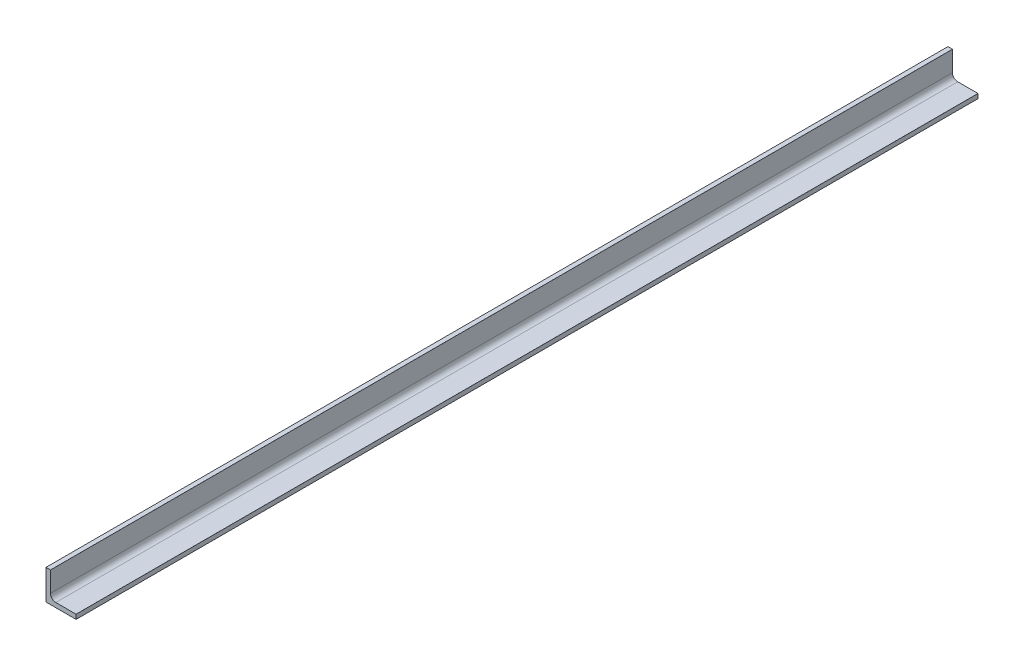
from build123d import *

# Parameters (mm, degrees)
EXTRUDE_1_DEPTH = 600


with BuildPart() as part:
    # Sketch 1 → Extrude 1 (new body)
    with BuildSketch(Plane.XY):
        with BuildLine():
            Line((0, 0), (0, 20))
            Line((0, 20), (2.99, 20))
            ThreePointArc((2.99, 20), (2.997071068, 19.997071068), (3, 19.99))
            Line((3, 19.99), (3, 6.5))
            ThreePointArc((3, 6.5), (4.025126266, 4.025126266), (6.5, 3))
            Line((6.5, 3), (19.99, 3))
            ThreePointArc((19.99, 3), (19.997071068, 2.997071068), (20, 2.99))
            Line((20, 2.99), (20, 0))
            Line((20, 0), (0, 0))
        make_face()
    extrude(amount=EXTRUDE_1_DEPTH)


solid = part.part
